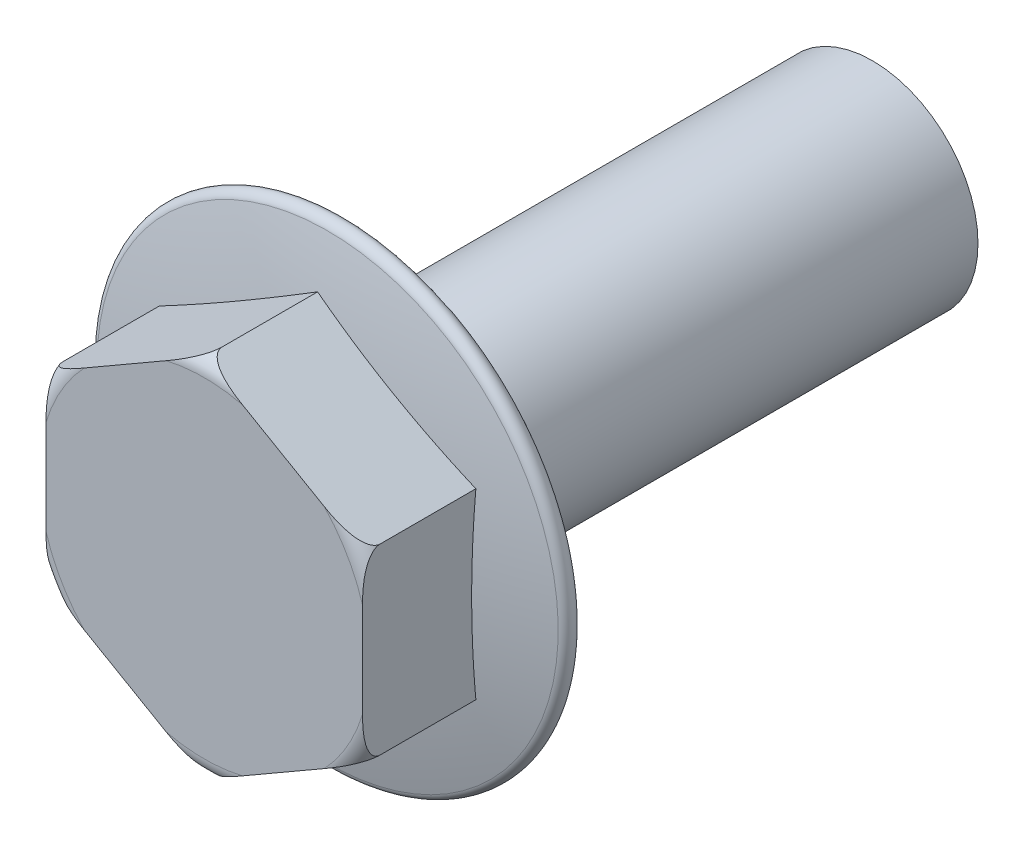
from build123d import *

# Parameters (mm, degrees)
HEAD_DEPTH         = 8
ESQUISSE1_R        = 6
BOSS_EXTRU_1_DEPTH = 30


with BuildPart() as part:
    # Head Sketch → Head (new body)
    with BuildSketch(Plane.XY):
        Polygon((0, 10.392304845), (9, 5.196152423), (9, -5.196152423), (0, -10.392304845), (-9, -5.196152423), (-9, 5.196152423), align=None)
    extrude(amount=HEAD_DEPTH)

    # Flange Sketch → Flange (revolve)
    with BuildSketch(Plane(origin=(0, 0, 0), x_dir=(-1, 0, 0), z_dir=(0, 1, 0)), mode=Mode.PRIVATE) as flange_sk:
        with BuildLine():
            Line((-13, 0), (0, 0))
            Line((0, 0), (0, 2.5))
            ThreePointArc((0, 2.5), (-6.600438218, 2.120464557), (-13.113868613, 0.986861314))
            ThreePointArc((-13.113868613, 0.986861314), (-13.496704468, 0.442687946), (-13, 0))
        make_face()
    revolve(flange_sk.sketch.rotate(Axis((0, 0, 1.843425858), (0, 0, 1)), 30), axis=Axis((0, 0, 1.843425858), (0, 0, 1)))

    # Sketch5 → Head Trim (revolve, cut)
    with BuildSketch(Plane(origin=(0, 0, 0), x_dir=(0, 0, -1), z_dir=(1, 0, 0)), mode=Mode.PRIVATE) as head_trim_sk:
        with BuildLine():
            Line((-8, -9.392304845), (-8, -10.392304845))
            Line((-8, -10.392304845), (-7, -10.392304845))
            ThreePointArc((-7, -10.392304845), (-7.707106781, -10.099411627), (-8, -9.392304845))
        make_face()
    revolve(head_trim_sk.sketch.rotate(Axis((0, 0, 15.085599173), (0, 0, -1)), 90), axis=Axis((0, 0, 15.085599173), (0, 0, -1)), mode=Mode.SUBTRACT)

    # Esquisse1 → Boss.-Extru.1 (add)
    with BuildSketch(Plane(origin=(0, 0, 0), x_dir=(-1, 0, 0), z_dir=(0, 0, -1))):
        with Locations(Location((0, 0, 0), (0, 0, 180))):
            Circle(ESQUISSE1_R)
    extrude(amount=BOSS_EXTRU_1_DEPTH)


solid = part.part
